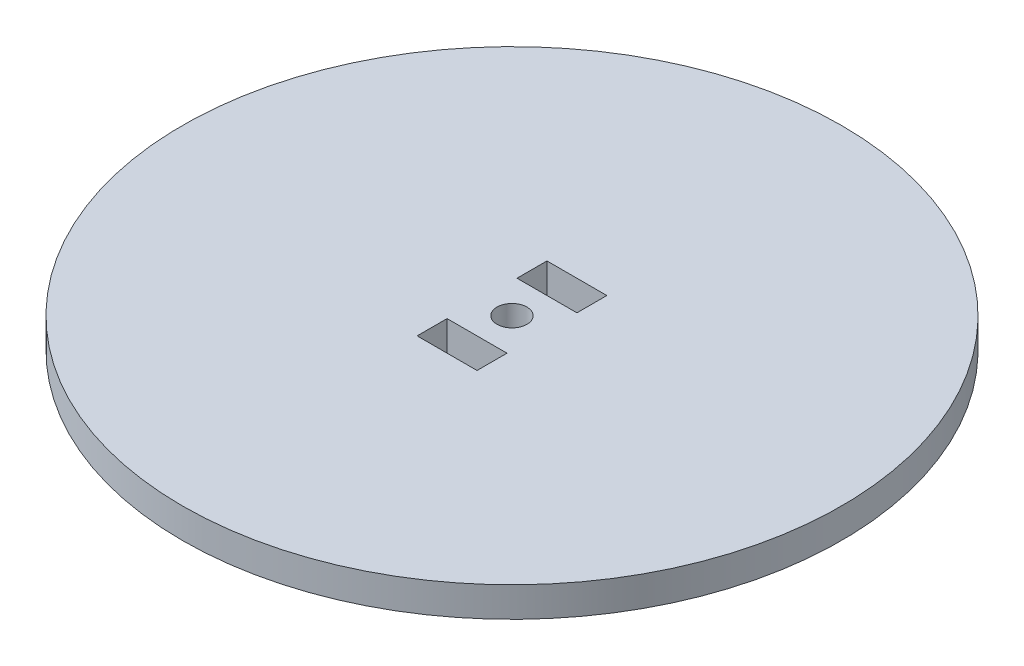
ISO-10303-21;
HEADER;
FILE_DESCRIPTION(('STEP AP214'),'2;1');
FILE_NAME('part.step','',(''),(''),'','','');
FILE_SCHEMA(('AUTOMOTIVE_DESIGN { 1 0 10303 214 1 1 1 1 }'));
ENDSEC;
DATA;
#1=APPLICATION_CONTEXT('core data for automotive mechanical design processes');
#2=APPLICATION_PROTOCOL_DEFINITION('international standard','automotive_design',2000,#1);
#3=PRODUCT_CONTEXT('',#1,'mechanical');
#4=PRODUCT('Part','Part','',(#3));
#5=PRODUCT_RELATED_PRODUCT_CATEGORY('part','',(#4));
#6=PRODUCT_DEFINITION_FORMATION('','',#4);
#7=PRODUCT_DEFINITION_CONTEXT('part definition',#1,'design');
#8=PRODUCT_DEFINITION('design','',#6,#7);
#9=PRODUCT_DEFINITION_SHAPE('','',#8);
#10=(LENGTH_UNIT() NAMED_UNIT(*) SI_UNIT(.MILLI.,.METRE.));
#11=(NAMED_UNIT(*) PLANE_ANGLE_UNIT() SI_UNIT($,.RADIAN.));
#12=(NAMED_UNIT(*) SI_UNIT($,.STERADIAN.) SOLID_ANGLE_UNIT());
#13=UNCERTAINTY_MEASURE_WITH_UNIT(LENGTH_MEASURE(1.E-05),#10,'distance_accuracy_value','');
#14=(GEOMETRIC_REPRESENTATION_CONTEXT(3) GLOBAL_UNCERTAINTY_ASSIGNED_CONTEXT((#13)) GLOBAL_UNIT_ASSIGNED_CONTEXT((#10,
#11,#12)) REPRESENTATION_CONTEXT('',''));
#15=CARTESIAN_POINT('',(0.,0.,0.));
#16=DIRECTION('',(0.,0.,1.));
#17=DIRECTION('',(1.,0.,0.));
#18=AXIS2_PLACEMENT_3D('',#15,#16,#17);
#19=CARTESIAN_POINT('',(0.,3.,0.));
#20=DIRECTION('',(0.,1.,0.));
#21=DIRECTION('',(0.,0.,1.));
#22=AXIS2_PLACEMENT_3D('',#19,#20,#21);
#23=PLANE('',#22);
#24=DIRECTION('',(0.,0.,1.));
#25=VECTOR('',#24,1.);
#26=CARTESIAN_POINT('',(-3.,3.,6.5));
#27=LINE('',#26,#25);
#28=CARTESIAN_POINT('',(-3.,3.,3.5));
#29=VERTEX_POINT('',#28);
#30=CARTESIAN_POINT('',(-3.,3.,6.5));
#31=VERTEX_POINT('',#30);
#32=EDGE_CURVE('E47',#29,#31,#27,.T.);
#33=ORIENTED_EDGE('',*,*,#32,.F.);
#34=DIRECTION('',(-1.,0.,0.));
#35=VECTOR('',#34,1.);
#36=CARTESIAN_POINT('',(-3.,3.,3.5));
#37=LINE('',#36,#35);
#38=CARTESIAN_POINT('',(3.,3.,3.5));
#39=VERTEX_POINT('',#38);
#40=EDGE_CURVE('E120',#39,#29,#37,.T.);
#41=ORIENTED_EDGE('',*,*,#40,.F.);
#42=DIRECTION('',(0.,0.,-1.));
#43=VECTOR('',#42,1.);
#44=CARTESIAN_POINT('',(3.,3.,3.5));
#45=LINE('',#44,#43);
#46=CARTESIAN_POINT('',(3.,3.,6.5));
#47=VERTEX_POINT('',#46);
#48=EDGE_CURVE('E104',#47,#39,#45,.T.);
#49=ORIENTED_EDGE('',*,*,#48,.F.);
#50=DIRECTION('',(1.,0.,0.));
#51=VECTOR('',#50,1.);
#52=CARTESIAN_POINT('',(-3.,3.,6.5));
#53=LINE('',#52,#51);
#54=EDGE_CURVE('E114',#31,#47,#53,.T.);
#55=ORIENTED_EDGE('',*,*,#54,.F.);
#56=EDGE_LOOP('',(#33,#41,#49,#55));
#57=FACE_BOUND('',#56,.T.);
#58=DIRECTION('',(1.,0.,0.));
#59=VECTOR('',#58,1.);
#60=CARTESIAN_POINT('',(-3.,3.,-3.5));
#61=LINE('',#60,#59);
#62=CARTESIAN_POINT('',(-3.,3.,-3.5));
#63=VERTEX_POINT('',#62);
#64=CARTESIAN_POINT('',(3.,3.,-3.5));
#65=VERTEX_POINT('',#64);
#66=EDGE_CURVE('E55',#63,#65,#61,.T.);
#67=ORIENTED_EDGE('',*,*,#66,.F.);
#68=DIRECTION('',(0.,0.,1.));
#69=VECTOR('',#68,1.);
#70=CARTESIAN_POINT('',(-3.,3.,-6.5));
#71=LINE('',#70,#69);
#72=CARTESIAN_POINT('',(-3.,3.,-6.5));
#73=VERTEX_POINT('',#72);
#74=EDGE_CURVE('E137',#73,#63,#71,.T.);
#75=ORIENTED_EDGE('',*,*,#74,.F.);
#76=DIRECTION('',(-1.,0.,0.));
#77=VECTOR('',#76,1.);
#78=CARTESIAN_POINT('',(3.,3.,-6.5));
#79=LINE('',#78,#77);
#80=CARTESIAN_POINT('',(3.,3.,-6.5));
#81=VERTEX_POINT('',#80);
#82=EDGE_CURVE('E134',#81,#73,#79,.T.);
#83=ORIENTED_EDGE('',*,*,#82,.F.);
#84=DIRECTION('',(0.,0.,-1.));
#85=VECTOR('',#84,1.);
#86=CARTESIAN_POINT('',(3.,3.,-3.5));
#87=LINE('',#86,#85);
#88=EDGE_CURVE('E131',#65,#81,#87,.T.);
#89=ORIENTED_EDGE('',*,*,#88,.F.);
#90=EDGE_LOOP('',(#67,#75,#83,#89));
#91=FACE_BOUND('',#90,.T.);
#92=CARTESIAN_POINT('',(0.,3.,0.));
#93=DIRECTION('',(0.,1.,0.));
#94=DIRECTION('',(0.,0.,1.));
#95=AXIS2_PLACEMENT_3D('',#92,#93,#94);
#96=CIRCLE('',#95,33.);
#97=CARTESIAN_POINT('',(0.,3.,33.));
#98=VERTEX_POINT('',#97);
#99=EDGE_CURVE('E154',#98,#98,#96,.T.);
#100=ORIENTED_EDGE('',*,*,#99,.T.);
#101=EDGE_LOOP('',(#100));
#102=FACE_BOUND('',#101,.T.);
#103=CARTESIAN_POINT('',(0.,3.,0.));
#104=DIRECTION('',(0.,1.,0.));
#105=DIRECTION('',(0.,0.,1.));
#106=AXIS2_PLACEMENT_3D('',#103,#104,#105);
#107=CIRCLE('',#106,1.5);
#108=CARTESIAN_POINT('',(0.,3.,1.5));
#109=VERTEX_POINT('',#108);
#110=EDGE_CURVE('E148',#109,#109,#107,.T.);
#111=ORIENTED_EDGE('',*,*,#110,.F.);
#112=EDGE_LOOP('',(#111));
#113=FACE_BOUND('',#112,.T.);
#114=ADVANCED_FACE('F32',(#57,#91,#102,#113),#23,.T.);
#115=CARTESIAN_POINT('',(0.,0.,0.));
#116=DIRECTION('',(0.,1.,0.));
#117=DIRECTION('',(0.,0.,1.));
#118=AXIS2_PLACEMENT_3D('',#115,#116,#117);
#119=PLANE('',#118);
#120=DIRECTION('',(-1.,0.,0.));
#121=VECTOR('',#120,1.);
#122=CARTESIAN_POINT('',(0.,0.,3.5));
#123=LINE('',#122,#121);
#124=CARTESIAN_POINT('',(3.,0.,3.5));
#125=VERTEX_POINT('',#124);
#126=CARTESIAN_POINT('',(-3.,0.,3.5));
#127=VERTEX_POINT('',#126);
#128=EDGE_CURVE('E40',#125,#127,#123,.T.);
#129=ORIENTED_EDGE('',*,*,#128,.T.);
#130=DIRECTION('',(0.,0.,1.));
#131=VECTOR('',#130,1.);
#132=CARTESIAN_POINT('',(-3.,0.,0.));
#133=LINE('',#132,#131);
#134=CARTESIAN_POINT('',(-3.,0.,6.5));
#135=VERTEX_POINT('',#134);
#136=EDGE_CURVE('E11',#127,#135,#133,.T.);
#137=ORIENTED_EDGE('',*,*,#136,.T.);
#138=DIRECTION('',(1.,0.,0.));
#139=VECTOR('',#138,1.);
#140=CARTESIAN_POINT('',(0.,0.,6.5));
#141=LINE('',#140,#139);
#142=CARTESIAN_POINT('',(3.,0.,6.5));
#143=VERTEX_POINT('',#142);
#144=EDGE_CURVE('E171',#135,#143,#141,.T.);
#145=ORIENTED_EDGE('',*,*,#144,.T.);
#146=DIRECTION('',(0.,0.,-1.));
#147=VECTOR('',#146,1.);
#148=CARTESIAN_POINT('',(3.,0.,0.));
#149=LINE('',#148,#147);
#150=EDGE_CURVE('E107',#143,#125,#149,.T.);
#151=ORIENTED_EDGE('',*,*,#150,.T.);
#152=EDGE_LOOP('',(#129,#137,#145,#151));
#153=FACE_BOUND('',#152,.T.);
#154=DIRECTION('',(0.,0.,1.));
#155=VECTOR('',#154,1.);
#156=CARTESIAN_POINT('',(-3.,0.,0.));
#157=LINE('',#156,#155);
#158=CARTESIAN_POINT('',(-3.,0.,-6.5));
#159=VERTEX_POINT('',#158);
#160=CARTESIAN_POINT('',(-3.,0.,-3.5));
#161=VERTEX_POINT('',#160);
#162=EDGE_CURVE('E165',#159,#161,#157,.T.);
#163=ORIENTED_EDGE('',*,*,#162,.T.);
#164=DIRECTION('',(1.,0.,0.));
#165=VECTOR('',#164,1.);
#166=CARTESIAN_POINT('',(0.,0.,-3.5));
#167=LINE('',#166,#165);
#168=CARTESIAN_POINT('',(3.,0.,-3.5));
#169=VERTEX_POINT('',#168);
#170=EDGE_CURVE('E168',#161,#169,#167,.T.);
#171=ORIENTED_EDGE('',*,*,#170,.T.);
#172=DIRECTION('',(0.,0.,-1.));
#173=VECTOR('',#172,1.);
#174=CARTESIAN_POINT('',(3.,0.,0.));
#175=LINE('',#174,#173);
#176=CARTESIAN_POINT('',(3.,0.,-6.5));
#177=VERTEX_POINT('',#176);
#178=EDGE_CURVE('E157',#169,#177,#175,.T.);
#179=ORIENTED_EDGE('',*,*,#178,.T.);
#180=DIRECTION('',(-1.,0.,0.));
#181=VECTOR('',#180,1.);
#182=CARTESIAN_POINT('',(0.,0.,-6.5));
#183=LINE('',#182,#181);
#184=EDGE_CURVE('E162',#177,#159,#183,.T.);
#185=ORIENTED_EDGE('',*,*,#184,.T.);
#186=EDGE_LOOP('',(#163,#171,#179,#185));
#187=FACE_BOUND('',#186,.T.);
#188=CARTESIAN_POINT('',(0.,0.,0.));
#189=DIRECTION('',(0.,1.,0.));
#190=DIRECTION('',(0.,0.,1.));
#191=AXIS2_PLACEMENT_3D('',#188,#189,#190);
#192=CIRCLE('',#191,33.);
#193=CARTESIAN_POINT('',(0.,0.,33.));
#194=VERTEX_POINT('',#193);
#195=EDGE_CURVE('E151',#194,#194,#192,.T.);
#196=ORIENTED_EDGE('',*,*,#195,.F.);
#197=EDGE_LOOP('',(#196));
#198=FACE_BOUND('',#197,.T.);
#199=CARTESIAN_POINT('',(0.,0.,0.));
#200=DIRECTION('',(0.,1.,0.));
#201=DIRECTION('',(0.,0.,1.));
#202=AXIS2_PLACEMENT_3D('',#199,#200,#201);
#203=CIRCLE('',#202,1.5);
#204=CARTESIAN_POINT('',(0.,0.,1.5));
#205=VERTEX_POINT('',#204);
#206=EDGE_CURVE('E127',#205,#205,#203,.T.);
#207=ORIENTED_EDGE('',*,*,#206,.T.);
#208=EDGE_LOOP('',(#207));
#209=FACE_BOUND('',#208,.T.);
#210=ADVANCED_FACE('F175',(#153,#187,#198,#209),#119,.F.);
#211=CARTESIAN_POINT('',(0.,3.,0.));
#212=DIRECTION('',(0.,-1.,0.));
#213=DIRECTION('',(0.,0.,-1.));
#214=AXIS2_PLACEMENT_3D('',#211,#212,#213);
#215=CYLINDRICAL_SURFACE('',#214,33.);
#216=ORIENTED_EDGE('',*,*,#99,.F.);
#217=EDGE_LOOP('',(#216));
#218=FACE_BOUND('',#217,.T.);
#219=ORIENTED_EDGE('',*,*,#195,.T.);
#220=EDGE_LOOP('',(#219));
#221=FACE_BOUND('',#220,.T.);
#222=ADVANCED_FACE('F34',(#218,#221),#215,.T.);
#223=CARTESIAN_POINT('',(0.,3.,0.));
#224=DIRECTION('',(0.,-1.,0.));
#225=DIRECTION('',(0.,0.,-1.));
#226=AXIS2_PLACEMENT_3D('',#223,#224,#225);
#227=CYLINDRICAL_SURFACE('',#226,1.5);
#228=ORIENTED_EDGE('',*,*,#110,.T.);
#229=EDGE_LOOP('',(#228));
#230=FACE_BOUND('',#229,.T.);
#231=ORIENTED_EDGE('',*,*,#206,.F.);
#232=EDGE_LOOP('',(#231));
#233=FACE_BOUND('',#232,.T.);
#234=ADVANCED_FACE('F200',(#230,#233),#227,.F.);
#235=CARTESIAN_POINT('',(-3.,-2.,-3.5));
#236=DIRECTION('',(0.,0.,1.));
#237=DIRECTION('',(1.,0.,0.));
#238=AXIS2_PLACEMENT_3D('',#235,#236,#237);
#239=PLANE('',#238);
#240=DIRECTION('',(0.,1.,0.));
#241=VECTOR('',#240,1.);
#242=CARTESIAN_POINT('',(-3.,-2.,-3.5));
#243=LINE('',#242,#241);
#244=EDGE_CURVE('E141',#161,#63,#243,.T.);
#245=ORIENTED_EDGE('',*,*,#244,.T.);
#246=ORIENTED_EDGE('',*,*,#66,.T.);
#247=DIRECTION('',(0.,1.,0.));
#248=VECTOR('',#247,1.);
#249=CARTESIAN_POINT('',(3.,-2.,-3.5));
#250=LINE('',#249,#248);
#251=EDGE_CURVE('E140',#169,#65,#250,.T.);
#252=ORIENTED_EDGE('',*,*,#251,.F.);
#253=ORIENTED_EDGE('',*,*,#170,.F.);
#254=EDGE_LOOP('',(#245,#246,#252,#253));
#255=FACE_BOUND('',#254,.T.);
#256=ADVANCED_FACE('F203',(#255),#239,.F.);
#257=CARTESIAN_POINT('',(-3.,-2.,-6.5));
#258=DIRECTION('',(-1.,0.,0.));
#259=DIRECTION('',(0.,0.,1.));
#260=AXIS2_PLACEMENT_3D('',#257,#258,#259);
#261=PLANE('',#260);
#262=DIRECTION('',(0.,1.,0.));
#263=VECTOR('',#262,1.);
#264=CARTESIAN_POINT('',(-3.,-2.,-6.5));
#265=LINE('',#264,#263);
#266=EDGE_CURVE('E143',#159,#73,#265,.T.);
#267=ORIENTED_EDGE('',*,*,#266,.T.);
#268=ORIENTED_EDGE('',*,*,#74,.T.);
#269=ORIENTED_EDGE('',*,*,#244,.F.);
#270=ORIENTED_EDGE('',*,*,#162,.F.);
#271=EDGE_LOOP('',(#267,#268,#269,#270));
#272=FACE_BOUND('',#271,.T.);
#273=ADVANCED_FACE('F206',(#272),#261,.F.);
#274=CARTESIAN_POINT('',(3.,-2.,-6.5));
#275=DIRECTION('',(0.,0.,-1.));
#276=DIRECTION('',(-1.,0.,0.));
#277=AXIS2_PLACEMENT_3D('',#274,#275,#276);
#278=PLANE('',#277);
#279=DIRECTION('',(0.,1.,0.));
#280=VECTOR('',#279,1.);
#281=CARTESIAN_POINT('',(3.,-2.,-6.5));
#282=LINE('',#281,#280);
#283=EDGE_CURVE('E145',#177,#81,#282,.T.);
#284=ORIENTED_EDGE('',*,*,#283,.T.);
#285=ORIENTED_EDGE('',*,*,#82,.T.);
#286=ORIENTED_EDGE('',*,*,#266,.F.);
#287=ORIENTED_EDGE('',*,*,#184,.F.);
#288=EDGE_LOOP('',(#284,#285,#286,#287));
#289=FACE_BOUND('',#288,.T.);
#290=ADVANCED_FACE('F189',(#289),#278,.F.);
#291=CARTESIAN_POINT('',(3.,-2.,-3.5));
#292=DIRECTION('',(1.,0.,0.));
#293=DIRECTION('',(0.,0.,-1.));
#294=AXIS2_PLACEMENT_3D('',#291,#292,#293);
#295=PLANE('',#294);
#296=ORIENTED_EDGE('',*,*,#251,.T.);
#297=ORIENTED_EDGE('',*,*,#88,.T.);
#298=ORIENTED_EDGE('',*,*,#283,.F.);
#299=ORIENTED_EDGE('',*,*,#178,.F.);
#300=EDGE_LOOP('',(#296,#297,#298,#299));
#301=FACE_BOUND('',#300,.T.);
#302=ADVANCED_FACE('F182',(#301),#295,.F.);
#303=CARTESIAN_POINT('',(-3.,-2.,6.5));
#304=DIRECTION('',(-1.,0.,0.));
#305=DIRECTION('',(0.,0.,1.));
#306=AXIS2_PLACEMENT_3D('',#303,#304,#305);
#307=PLANE('',#306);
#308=DIRECTION('',(0.,1.,0.));
#309=VECTOR('',#308,1.);
#310=CARTESIAN_POINT('',(-3.,-2.,3.5));
#311=LINE('',#310,#309);
#312=EDGE_CURVE('E125',#127,#29,#311,.T.);
#313=ORIENTED_EDGE('',*,*,#312,.T.);
#314=ORIENTED_EDGE('',*,*,#32,.T.);
#315=DIRECTION('',(0.,1.,0.));
#316=VECTOR('',#315,1.);
#317=CARTESIAN_POINT('',(-3.,-2.,6.5));
#318=LINE('',#317,#316);
#319=EDGE_CURVE('E111',#135,#31,#318,.T.);
#320=ORIENTED_EDGE('',*,*,#319,.F.);
#321=ORIENTED_EDGE('',*,*,#136,.F.);
#322=EDGE_LOOP('',(#313,#314,#320,#321));
#323=FACE_BOUND('',#322,.T.);
#324=ADVANCED_FACE('F180',(#323),#307,.F.);
#325=CARTESIAN_POINT('',(-3.,-2.,3.5));
#326=DIRECTION('',(0.,0.,-1.));
#327=DIRECTION('',(-1.,0.,0.));
#328=AXIS2_PLACEMENT_3D('',#325,#326,#327);
#329=PLANE('',#328);
#330=DIRECTION('',(0.,1.,0.));
#331=VECTOR('',#330,1.);
#332=CARTESIAN_POINT('',(3.,-2.,3.5));
#333=LINE('',#332,#331);
#334=EDGE_CURVE('E110',#125,#39,#333,.T.);
#335=ORIENTED_EDGE('',*,*,#334,.T.);
#336=ORIENTED_EDGE('',*,*,#40,.T.);
#337=ORIENTED_EDGE('',*,*,#312,.F.);
#338=ORIENTED_EDGE('',*,*,#128,.F.);
#339=EDGE_LOOP('',(#335,#336,#337,#338));
#340=FACE_BOUND('',#339,.T.);
#341=ADVANCED_FACE('F179',(#340),#329,.F.);
#342=CARTESIAN_POINT('',(3.,-2.,3.5));
#343=DIRECTION('',(1.,0.,0.));
#344=DIRECTION('',(0.,0.,-1.));
#345=AXIS2_PLACEMENT_3D('',#342,#343,#344);
#346=PLANE('',#345);
#347=DIRECTION('',(0.,1.,0.));
#348=VECTOR('',#347,1.);
#349=CARTESIAN_POINT('',(3.,-2.,6.5));
#350=LINE('',#349,#348);
#351=EDGE_CURVE('E99',#143,#47,#350,.T.);
#352=ORIENTED_EDGE('',*,*,#351,.T.);
#353=ORIENTED_EDGE('',*,*,#48,.T.);
#354=ORIENTED_EDGE('',*,*,#334,.F.);
#355=ORIENTED_EDGE('',*,*,#150,.F.);
#356=EDGE_LOOP('',(#352,#353,#354,#355));
#357=FACE_BOUND('',#356,.T.);
#358=ADVANCED_FACE('F101',(#357),#346,.F.);
#359=CARTESIAN_POINT('',(-3.,-2.,6.5));
#360=DIRECTION('',(0.,0.,1.));
#361=DIRECTION('',(1.,0.,0.));
#362=AXIS2_PLACEMENT_3D('',#359,#360,#361);
#363=PLANE('',#362);
#364=ORIENTED_EDGE('',*,*,#319,.T.);
#365=ORIENTED_EDGE('',*,*,#54,.T.);
#366=ORIENTED_EDGE('',*,*,#351,.F.);
#367=ORIENTED_EDGE('',*,*,#144,.F.);
#368=EDGE_LOOP('',(#364,#365,#366,#367));
#369=FACE_BOUND('',#368,.T.);
#370=ADVANCED_FACE('F115',(#369),#363,.F.);
#371=CLOSED_SHELL('',(#114,#210,#222,#234,#256,#273,#290,#302,#324,#341,#358,#370));
#372=MANIFOLD_SOLID_BREP('B2',#371);
#373=ADVANCED_BREP_SHAPE_REPRESENTATION('',(#18,#372),#14);
#374=SHAPE_DEFINITION_REPRESENTATION(#9,#373);
ENDSEC;
END-ISO-10303-21;
